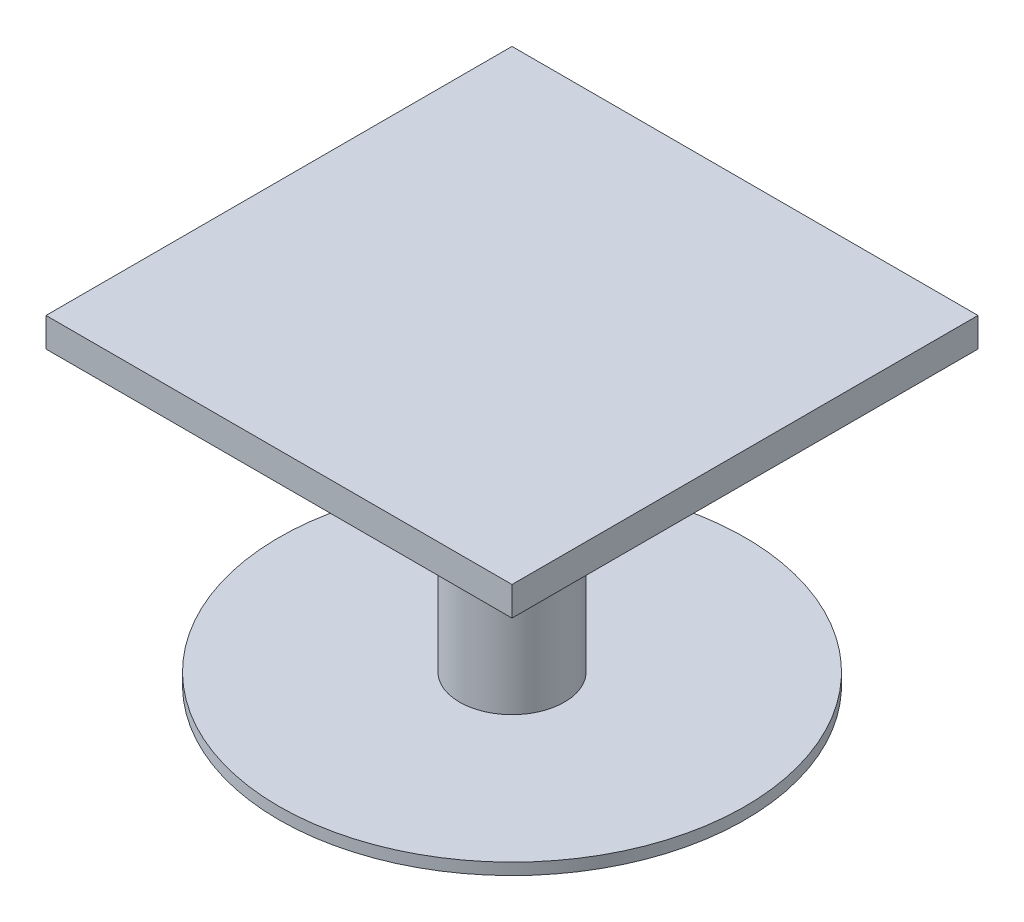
from build123d import *

# Parameters (mm, degrees)
ESQUISSE2_R        = 40
BOSS_EXTRU_2_DEPTH = 2
ESQUISSE4_W        = 80
ESQUISSE4_H        = 80
BOSS_EXTRU_3_DEPTH = 5
ESQUISSE3_R        = 9
BOSS_EXTRU_4_DEPTH = 48


with BuildPart() as part:
    # Esquisse2 → Boss.-Extru.2 (new body)
    with BuildSketch(Plane(origin=(0, -70, 0), x_dir=(-1, 0, 0), z_dir=(0, 1, 0))):
        with Locations(Location((0, 0, 0), (0, 0, 90))):
            Circle(ESQUISSE2_R)
    extrude(amount=BOSS_EXTRU_2_DEPTH)



with BuildPart() as body_2:
    # Esquisse4 → Boss.-Extru.3 (new body)
    with BuildSketch(Plane(origin=(0, -20, 0), x_dir=(-1, 0, 0), z_dir=(0, 1, 0))):
        Rectangle(ESQUISSE4_W, ESQUISSE4_H)
    extrude(amount=BOSS_EXTRU_3_DEPTH)


with BuildPart() as part_1:
    add(part.part)

    add(body_2.part)  # Boss.-Extru.4 merges body 2
    # Esquisse3 → Boss.-Extru.4 (add)
    with BuildSketch(Plane(origin=(0, -68, 0), x_dir=(1, 0, 0), z_dir=(0, 1, 0))):
        with Locations(Location((0, 0, 0), (0, 0, 270))):
            Circle(ESQUISSE3_R)
    extrude(amount=BOSS_EXTRU_4_DEPTH)


solid = part_1.part
